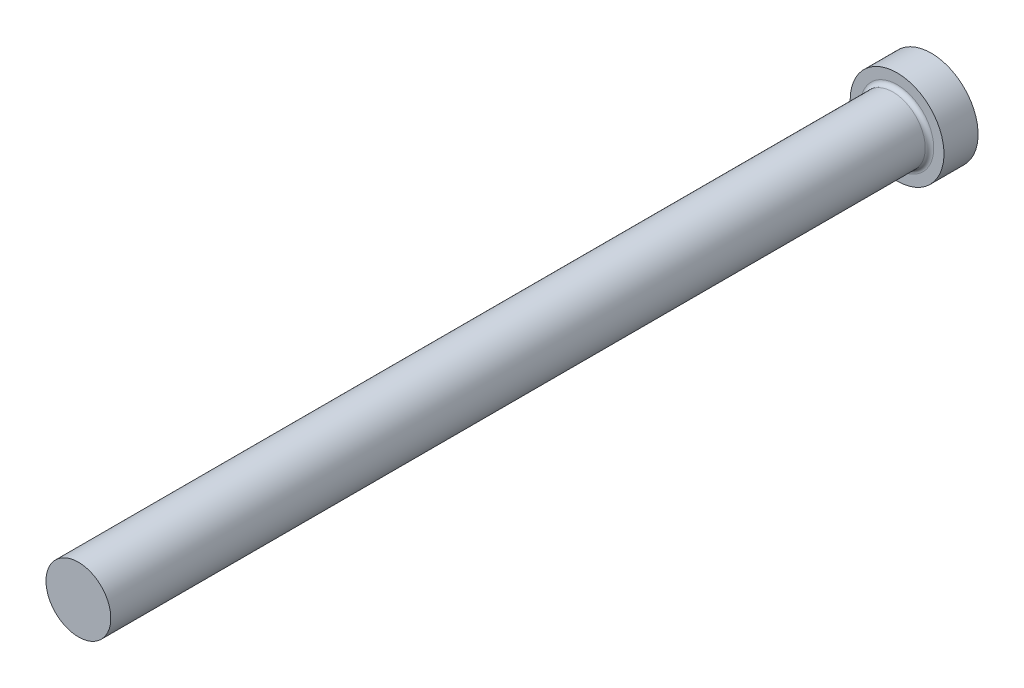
ISO-10303-21;
HEADER;
FILE_DESCRIPTION(('STEP AP214'),'2;1');
FILE_NAME('part.step','',(''),(''),'','','');
FILE_SCHEMA(('AUTOMOTIVE_DESIGN { 1 0 10303 214 1 1 1 1 }'));
ENDSEC;
DATA;
#1=APPLICATION_CONTEXT('core data for automotive mechanical design processes');
#2=APPLICATION_PROTOCOL_DEFINITION('international standard','automotive_design',2000,#1);
#3=PRODUCT_CONTEXT('',#1,'mechanical');
#4=PRODUCT('Part','Part','',(#3));
#5=PRODUCT_RELATED_PRODUCT_CATEGORY('part','',(#4));
#6=PRODUCT_DEFINITION_FORMATION('','',#4);
#7=PRODUCT_DEFINITION_CONTEXT('part definition',#1,'design');
#8=PRODUCT_DEFINITION('design','',#6,#7);
#9=PRODUCT_DEFINITION_SHAPE('','',#8);
#10=(LENGTH_UNIT() NAMED_UNIT(*) SI_UNIT(.MILLI.,.METRE.));
#11=(NAMED_UNIT(*) PLANE_ANGLE_UNIT() SI_UNIT($,.RADIAN.));
#12=(NAMED_UNIT(*) SI_UNIT($,.STERADIAN.) SOLID_ANGLE_UNIT());
#13=UNCERTAINTY_MEASURE_WITH_UNIT(LENGTH_MEASURE(1.E-05),#10,'distance_accuracy_value','');
#14=(GEOMETRIC_REPRESENTATION_CONTEXT(3) GLOBAL_UNCERTAINTY_ASSIGNED_CONTEXT((#13)) GLOBAL_UNIT_ASSIGNED_CONTEXT((#10,
#11,#12)) REPRESENTATION_CONTEXT('',''));
#15=CARTESIAN_POINT('',(0.,0.,0.));
#16=DIRECTION('',(0.,0.,1.));
#17=DIRECTION('',(1.,0.,0.));
#18=AXIS2_PLACEMENT_3D('',#15,#16,#17);
#19=CARTESIAN_POINT('',(5.5,0.,4.));
#20=DIRECTION('',(0.,0.,-1.));
#21=DIRECTION('',(-1.,0.,0.));
#22=AXIS2_PLACEMENT_3D('',#19,#20,#21);
#23=PLANE('',#22);
#24=CARTESIAN_POINT('',(0.,0.,4.));
#25=DIRECTION('',(0.,0.,-1.));
#26=DIRECTION('',(-1.,0.,0.));
#27=AXIS2_PLACEMENT_3D('',#24,#25,#26);
#28=CIRCLE('',#27,4.30000000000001);
#29=CARTESIAN_POINT('',(-4.30000000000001,0.,4.));
#30=VERTEX_POINT('',#29);
#31=EDGE_CURVE('E40',#30,#30,#28,.T.);
#32=ORIENTED_EDGE('',*,*,#31,.T.);
#33=EDGE_LOOP('',(#32));
#34=FACE_BOUND('',#33,.T.);
#35=CARTESIAN_POINT('',(0.,0.,4.));
#36=DIRECTION('',(0.,0.,-1.));
#37=DIRECTION('',(-1.,0.,0.));
#38=AXIS2_PLACEMENT_3D('',#35,#36,#37);
#39=CIRCLE('',#38,5.5);
#40=CARTESIAN_POINT('',(-5.5,0.,4.));
#41=VERTEX_POINT('',#40);
#42=EDGE_CURVE('E44',#41,#41,#39,.T.);
#43=ORIENTED_EDGE('',*,*,#42,.F.);
#44=EDGE_LOOP('',(#43));
#45=FACE_BOUND('',#44,.T.);
#46=ADVANCED_FACE('F33',(#34,#45),#23,.F.);
#47=CARTESIAN_POINT('',(0.,0.,-9.03322817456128));
#48=DIRECTION('',(0.,0.,-1.));
#49=DIRECTION('',(-1.,0.,0.));
#50=AXIS2_PLACEMENT_3D('',#47,#48,#49);
#51=CYLINDRICAL_SURFACE('',#50,5.5);
#52=CARTESIAN_POINT('',(0.,0.,0.));
#53=DIRECTION('',(0.,0.,-1.));
#54=DIRECTION('',(-1.,0.,0.));
#55=AXIS2_PLACEMENT_3D('',#52,#53,#54);
#56=CIRCLE('',#55,5.5);
#57=CARTESIAN_POINT('',(-5.5,0.,0.));
#58=VERTEX_POINT('',#57);
#59=EDGE_CURVE('E48',#58,#58,#56,.T.);
#60=ORIENTED_EDGE('',*,*,#59,.F.);
#61=EDGE_LOOP('',(#60));
#62=FACE_BOUND('',#61,.T.);
#63=ORIENTED_EDGE('',*,*,#42,.T.);
#64=EDGE_LOOP('',(#63));
#65=FACE_BOUND('',#64,.T.);
#66=ADVANCED_FACE('F68',(#62,#65),#51,.T.);
#67=CARTESIAN_POINT('',(0.,0.,0.));
#68=DIRECTION('',(0.,0.,1.));
#69=DIRECTION('',(1.,0.,0.));
#70=AXIS2_PLACEMENT_3D('',#67,#68,#69);
#71=PLANE('',#70);
#72=ORIENTED_EDGE('',*,*,#59,.T.);
#73=EDGE_LOOP('',(#72));
#74=FACE_BOUND('',#73,.T.);
#75=ADVANCED_FACE('F61',(#74),#71,.F.);
#76=CARTESIAN_POINT('',(0.,0.,100.));
#77=DIRECTION('',(0.,0.,-1.));
#78=DIRECTION('',(-1.,0.,0.));
#79=AXIS2_PLACEMENT_3D('',#76,#77,#78);
#80=PLANE('',#79);
#81=CARTESIAN_POINT('',(0.,0.,100.));
#82=DIRECTION('',(0.,0.,-1.));
#83=DIRECTION('',(-1.,0.,0.));
#84=AXIS2_PLACEMENT_3D('',#81,#82,#83);
#85=CIRCLE('',#84,3.80000000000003);
#86=CARTESIAN_POINT('',(-3.80000000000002,0.,100.));
#87=VERTEX_POINT('',#86);
#88=EDGE_CURVE('E53',#87,#87,#85,.T.);
#89=ORIENTED_EDGE('',*,*,#88,.F.);
#90=EDGE_LOOP('',(#89));
#91=FACE_BOUND('',#90,.T.);
#92=ADVANCED_FACE('F59',(#91),#80,.F.);
#93=CARTESIAN_POINT('',(0.,0.,-9.03322817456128));
#94=DIRECTION('',(0.,0.,-1.));
#95=DIRECTION('',(-1.,0.,0.));
#96=AXIS2_PLACEMENT_3D('',#93,#94,#95);
#97=CYLINDRICAL_SURFACE('',#96,3.80000000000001);
#98=CARTESIAN_POINT('',(0.,0.,4.5));
#99=DIRECTION('',(0.,0.,-1.));
#100=DIRECTION('',(-1.,0.,0.));
#101=AXIS2_PLACEMENT_3D('',#98,#99,#100);
#102=CIRCLE('',#101,3.80000000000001);
#103=CARTESIAN_POINT('',(-3.80000000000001,0.,4.5));
#104=VERTEX_POINT('',#103);
#105=EDGE_CURVE('E10',#104,#104,#102,.F.);
#106=ORIENTED_EDGE('',*,*,#105,.T.);
#107=EDGE_LOOP('',(#106));
#108=FACE_BOUND('',#107,.T.);
#109=ORIENTED_EDGE('',*,*,#88,.T.);
#110=EDGE_LOOP('',(#109));
#111=FACE_BOUND('',#110,.T.);
#112=ADVANCED_FACE('F57',(#108,#111),#97,.T.);
#113=CARTESIAN_POINT('',(0.,0.,4.5));
#114=DIRECTION('',(0.,0.,-1.));
#115=DIRECTION('',(-1.,0.,0.));
#116=AXIS2_PLACEMENT_3D('',#113,#114,#115);
#117=TOROIDAL_SURFACE('',#116,4.30000000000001,0.5);
#118=ORIENTED_EDGE('',*,*,#105,.F.);
#119=EDGE_LOOP('',(#118));
#120=FACE_BOUND('',#119,.T.);
#121=ORIENTED_EDGE('',*,*,#31,.F.);
#122=EDGE_LOOP('',(#121));
#123=FACE_BOUND('',#122,.T.);
#124=ADVANCED_FACE('F35',(#120,#123),#117,.F.);
#125=CLOSED_SHELL('',(#46,#66,#75,#92,#112,#124));
#126=MANIFOLD_SOLID_BREP('B2',#125);
#127=ADVANCED_BREP_SHAPE_REPRESENTATION('',(#18,#126),#14);
#128=SHAPE_DEFINITION_REPRESENTATION(#9,#127);
ENDSEC;
END-ISO-10303-21;
